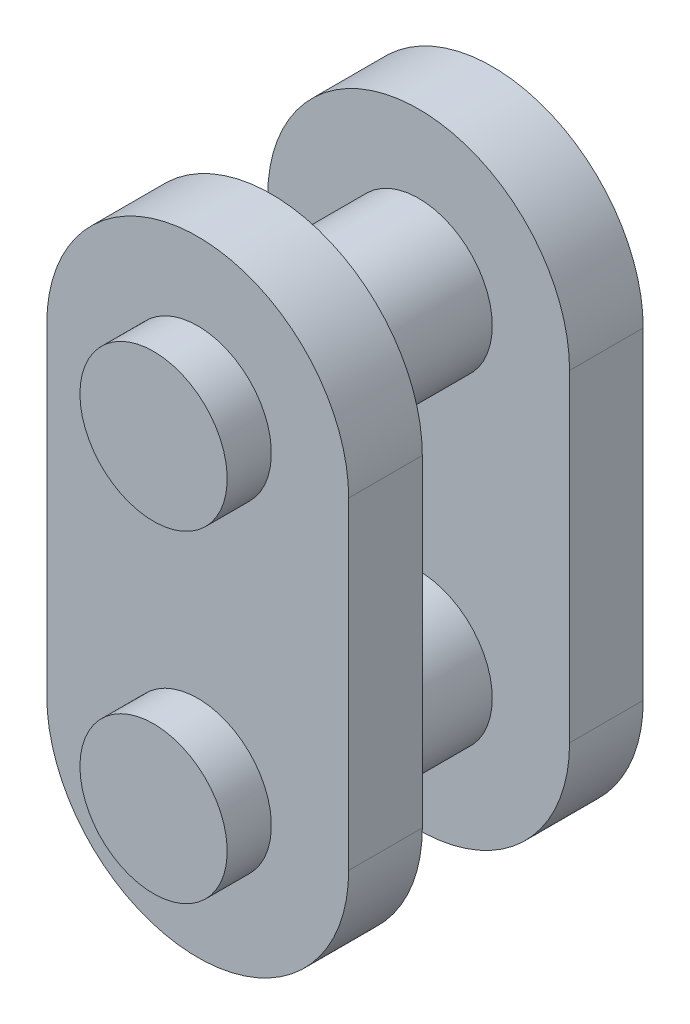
from build123d import *

# Parameters (mm, degrees)
BASIS_LINEAR_AUSTRAGEN_DEPTH    = 5
SKIZZE2_R                       = 2.5
SCHNITT_LINEAR_AUSTRAGEN1_DEPTH = 2.5
SKIZZE3_R                       = 2.5
AUFSATZ_LINEAR_AUSTRAGEN1_DEPTH = 6.5


with BuildPart() as part:
    # Skizze1 → Basis-Linear austragen (new, symmetric)
    with BuildSketch(Plane.XY):
        with BuildLine():
            Line((-5.125, 5.475), (-5.125, -5.475))
            ThreePointArc((-5.125, -5.475), (0, -10.6), (5.125, -5.475))
            Line((5.125, -5.475), (5.125, 5.475))
            ThreePointArc((5.125, 5.475), (0, 10.6), (-5.125, 5.475))
        make_face()
    extrude(amount=BASIS_LINEAR_AUSTRAGEN_DEPTH, both=True)

    # Skizze2 → Schnitt-Linear austragen1 (cut, symmetric)
    with BuildSketch(Plane.XY):
        with BuildLine():
            Line((-5.125, 5.475), (-5.125, -5.475))
            ThreePointArc((-5.125, -5.475), (0, -10.6), (5.125, -5.475))
            Line((5.125, -5.475), (5.125, 5.475))
            ThreePointArc((5.125, 5.475), (0, 10.6), (-5.125, 5.475))
        make_face()
        with Locations((0, 5.475)):
            Circle(SKIZZE2_R, mode=Mode.SUBTRACT)
        with Locations((0, -5.475)):
            Circle(SKIZZE2_R, mode=Mode.SUBTRACT)
    extrude(amount=SCHNITT_LINEAR_AUSTRAGEN1_DEPTH, both=True, mode=Mode.SUBTRACT)

    # Skizze3 → Aufsatz-Linear austragen1 (add, symmetric)
    with BuildSketch(Plane.XY):
        with Locations((0, -5.475)):
            Circle(SKIZZE3_R)
        with Locations((0, 5.475)):
            Circle(SKIZZE3_R)
    extrude(amount=AUFSATZ_LINEAR_AUSTRAGEN1_DEPTH, both=True)


solid = part.part
